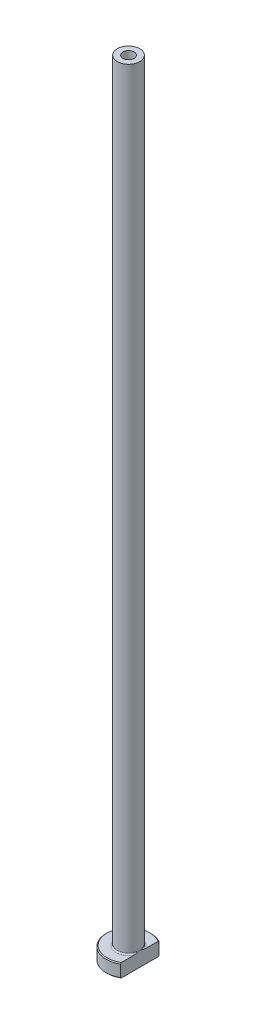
from build123d import *

# Parameters (mm, degrees)
FILLET1_R          = 0.3
CHAMFER1_SIZE      = 0.2
CUT_EXTRUDE1_DEPTH = 176.142798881
CHAMFER2_SIZE      = 0.5


with BuildPart() as part:
    # Sketch1 → Revolve1 (revolve)
    with BuildSketch(Plane.XY, mode=Mode.PRIVATE) as revolve1_sk:
        Polygon((-1.25, 175), (-2.5, 175), (-2.5, 3), (-5, 3), (-5, 0), (-1.5, 0), (-1.5, 128), (-1.25, 140), align=None)
    revolve(revolve1_sk.sketch.rotate(Axis((0, 92.187680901, 0), (0, -1, 0)), 270), axis=Axis((0, 92.187680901, 0), (0, -1, 0)))

    # Fillet1
    fillet1_edges = [part.edges().sort_by_distance(p)[0] for p in [
        (0, 3, -2.5),
    ]]
    fillet(fillet1_edges, radius=FILLET1_R)

    # Chamfer1
    chamfer1_edges = [part.edges().sort_by_distance(p)[0] for p in [
        (0, 0, -5),
        (0, 3, -5),
    ]]
    chamfer(chamfer1_edges, length=CHAMFER1_SIZE)

    # Sketch2 → Cut-Extrude1 (cut, through all)
    with BuildSketch(Plane.XZ):
        with BuildLine():
            Line((2.5, 4.330127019), (2.5, -4.330127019))
            ThreePointArc((2.5, -4.330127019), (5, 0), (2.5, 4.330127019))
        make_face()
    extrude(amount=-CUT_EXTRUDE1_DEPTH, mode=Mode.SUBTRACT)

    # Chamfer2
    chamfer2_edges = [part.edges().sort_by_distance(p)[0] for p in [
        (0, 0, -1.5),
    ]]
    chamfer(chamfer2_edges, length=CHAMFER2_SIZE)


solid = part.part
